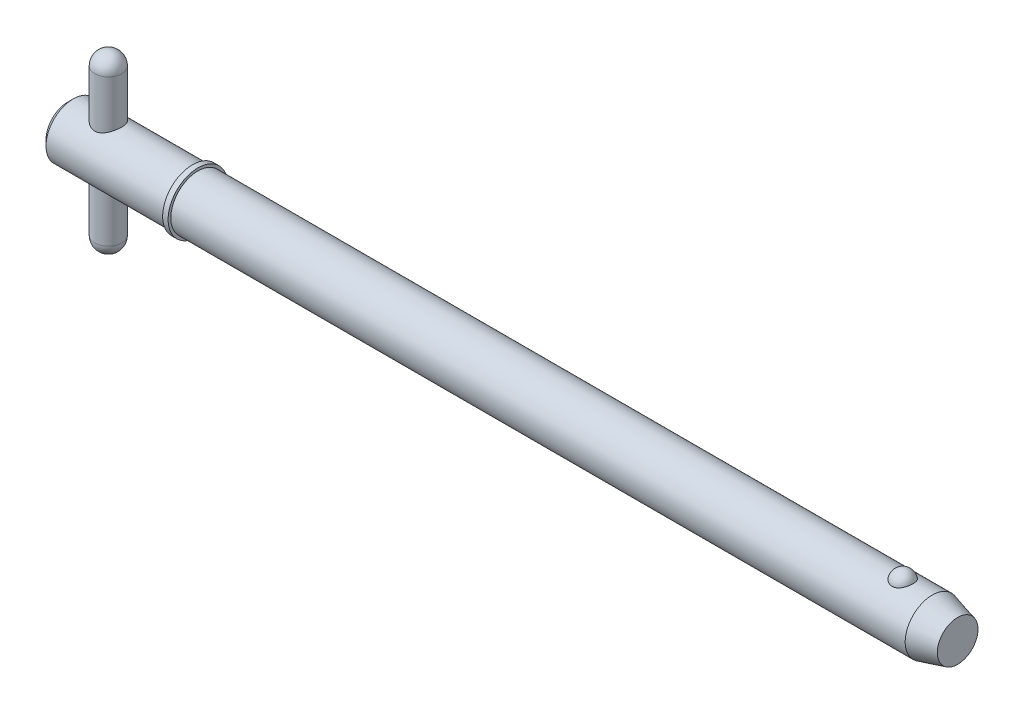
ISO-10303-21;
HEADER;
FILE_DESCRIPTION(('STEP AP214'),'2;1');
FILE_NAME('part.step','',(''),(''),'','','');
FILE_SCHEMA(('AUTOMOTIVE_DESIGN { 1 0 10303 214 1 1 1 1 }'));
ENDSEC;
DATA;
#1=APPLICATION_CONTEXT('core data for automotive mechanical design processes');
#2=APPLICATION_PROTOCOL_DEFINITION('international standard','automotive_design',2000,#1);
#3=PRODUCT_CONTEXT('',#1,'mechanical');
#4=PRODUCT('Part','Part','',(#3));
#5=PRODUCT_RELATED_PRODUCT_CATEGORY('part','',(#4));
#6=PRODUCT_DEFINITION_FORMATION('','',#4);
#7=PRODUCT_DEFINITION_CONTEXT('part definition',#1,'design');
#8=PRODUCT_DEFINITION('design','',#6,#7);
#9=PRODUCT_DEFINITION_SHAPE('','',#8);
#10=(LENGTH_UNIT() NAMED_UNIT(*) SI_UNIT(.MILLI.,.METRE.));
#11=(NAMED_UNIT(*) PLANE_ANGLE_UNIT() SI_UNIT($,.RADIAN.));
#12=(NAMED_UNIT(*) SI_UNIT($,.STERADIAN.) SOLID_ANGLE_UNIT());
#13=UNCERTAINTY_MEASURE_WITH_UNIT(LENGTH_MEASURE(1.E-05),#10,'distance_accuracy_value','');
#14=(GEOMETRIC_REPRESENTATION_CONTEXT(3) GLOBAL_UNCERTAINTY_ASSIGNED_CONTEXT((#13)) GLOBAL_UNIT_ASSIGNED_CONTEXT((#10,
#11,#12)) REPRESENTATION_CONTEXT('',''));
#15=CARTESIAN_POINT('',(0.,0.,0.));
#16=DIRECTION('',(0.,0.,1.));
#17=DIRECTION('',(1.,0.,0.));
#18=AXIS2_PLACEMENT_3D('',#15,#16,#17);
#19=CARTESIAN_POINT('',(5.94,12.7,0.));
#20=DIRECTION('',(0.,-1.,0.));
#21=DIRECTION('',(0.,0.,-1.));
#22=AXIS2_PLACEMENT_3D('',#19,#20,#21);
#23=CYLINDRICAL_SURFACE('',#22,1.98);
#24=CARTESIAN_POINT('',(5.94,-10.72,0.));
#25=DIRECTION('',(0.,-1.,0.));
#26=DIRECTION('',(0.,0.,-1.));
#27=AXIS2_PLACEMENT_3D('',#24,#25,#26);
#28=CIRCLE('',#27,1.98);
#29=CARTESIAN_POINT('',(5.94,-10.72,-1.98));
#30=VERTEX_POINT('',#29);
#31=EDGE_CURVE('P0_E10',#30,#30,#28,.F.);
#32=ORIENTED_EDGE('',*,*,#31,.T.);
#33=EDGE_LOOP('',(#32));
#34=FACE_BOUND('',#33,.T.);
#35=CARTESIAN_POINT('',(5.94,10.72,0.));
#36=DIRECTION('',(0.,-1.,0.));
#37=DIRECTION('',(0.,0.,-1.));
#38=AXIS2_PLACEMENT_3D('',#35,#36,#37);
#39=CIRCLE('',#38,1.98);
#40=CARTESIAN_POINT('',(5.94,10.72,-1.98));
#41=VERTEX_POINT('',#40);
#42=EDGE_CURVE('P0_E21',#41,#41,#39,.T.);
#43=ORIENTED_EDGE('',*,*,#42,.T.);
#44=EDGE_LOOP('',(#43));
#45=FACE_BOUND('',#44,.T.);
#46=ADVANCED_FACE('P0_F14',(#34,#45),#23,.T.);
#47=CARTESIAN_POINT('',(5.94,-10.72,0.));
#48=DIRECTION('',(0.,0.,1.));
#49=DIRECTION('',(1.,0.,0.));
#50=AXIS2_PLACEMENT_3D('',#47,#48,#49);
#51=SPHERICAL_SURFACE('',#50,1.98);
#52=CARTESIAN_POINT('',(5.94,-10.72,0.));
#53=DIRECTION('',(0.,-1.,0.));
#54=DIRECTION('',(0.,0.,-1.));
#55=AXIS2_PLACEMENT_3D('',#52,#53,#54);
#56=SPHERICAL_SURFACE('',#55,1.98);
#57=ORIENTED_EDGE('',*,*,#31,.F.);
#58=EDGE_LOOP('',(#57));
#59=FACE_BOUND('',#58,.T.);
#60=ADVANCED_FACE('P0_F29',(#59),#56,.T.);
#61=CARTESIAN_POINT('',(5.94,10.72,0.));
#62=DIRECTION('',(0.,0.,1.));
#63=DIRECTION('',(1.,0.,0.));
#64=AXIS2_PLACEMENT_3D('',#61,#62,#63);
#65=SPHERICAL_SURFACE('',#64,1.98);
#66=CARTESIAN_POINT('',(5.94,10.72,0.));
#67=DIRECTION('',(0.,-1.,0.));
#68=DIRECTION('',(0.,0.,-1.));
#69=AXIS2_PLACEMENT_3D('',#66,#67,#68);
#70=SPHERICAL_SURFACE('',#69,1.98);
#71=ORIENTED_EDGE('',*,*,#42,.F.);
#72=EDGE_LOOP('',(#71));
#73=FACE_BOUND('',#72,.T.);
#74=ADVANCED_FACE('P0_F16',(#73),#70,.T.);
#75=CLOSED_SHELL('',(#46,#60,#74));
#76=MANIFOLD_SOLID_BREP('P0_B1',#75);
#77=CARTESIAN_POINT('',(0.,0.,0.));
#78=DIRECTION('',(1.,0.,0.));
#79=DIRECTION('',(0.,0.,-1.));
#80=AXIS2_PLACEMENT_3D('',#77,#78,#79);
#81=CYLINDRICAL_SURFACE('',#80,3.97);
#82=CARTESIAN_POINT('',(126.475939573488,0.,0.));
#83=DIRECTION('',(1.,0.,0.));
#84=DIRECTION('',(0.,0.,-1.));
#85=AXIS2_PLACEMENT_3D('',#82,#83,#84);
#86=CIRCLE('',#85,3.97);
#87=CARTESIAN_POINT('',(126.475939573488,0.,-3.97));
#88=VERTEX_POINT('',#87);
#89=EDGE_CURVE('P1_E81',#88,#88,#86,.T.);
#90=ORIENTED_EDGE('',*,*,#89,.F.);
#91=EDGE_LOOP('',(#90));
#92=FACE_BOUND('',#91,.T.);
#93=CARTESIAN_POINT('',(19.05,0.,0.));
#94=DIRECTION('',(1.,0.,0.));
#95=DIRECTION('',(0.,0.,-1.));
#96=AXIS2_PLACEMENT_3D('',#93,#94,#95);
#97=CIRCLE('',#96,3.97);
#98=CARTESIAN_POINT('',(19.05,0.,-3.97));
#99=VERTEX_POINT('',#98);
#100=EDGE_CURVE('P1_E85',#99,#99,#97,.T.);
#101=ORIENTED_EDGE('',*,*,#100,.T.);
#102=EDGE_LOOP('',(#101));
#103=FACE_BOUND('',#102,.T.);
#104=CARTESIAN_POINT('',(122.145192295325,3.65715365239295,1.54470941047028));
#105=CARTESIAN_POINT('',(122.065244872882,3.65716001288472,1.54470290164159));
#106=CARTESIAN_POINT('',(121.985165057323,3.65987074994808,1.53832549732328));
#107=CARTESIAN_POINT('',(121.827237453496,3.6704221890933,1.51297018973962));
#108=CARTESIAN_POINT('',(121.74939614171,3.67827646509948,1.49395894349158));
#109=CARTESIAN_POINT('',(121.598461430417,3.69818848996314,1.44395950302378));
#110=CARTESIAN_POINT('',(121.525356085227,3.71023513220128,1.41300293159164));
#111=CARTESIAN_POINT('',(121.385563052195,3.73721833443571,1.34000212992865));
#112=CARTESIAN_POINT('',(121.318872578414,3.75215363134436,1.2979627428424));
#113=CARTESIAN_POINT('',(121.19148864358,3.78384968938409,1.20248834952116));
#114=CARTESIAN_POINT('',(121.131029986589,3.80065129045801,1.14875388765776));
#115=CARTESIAN_POINT('',(121.019694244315,3.83398532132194,1.03205417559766));
#116=CARTESIAN_POINT('',(120.968820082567,3.85051766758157,0.969086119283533));
#117=CARTESIAN_POINT('',(120.875632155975,3.88238608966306,0.832526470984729));
#118=CARTESIAN_POINT('',(120.833796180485,3.89763698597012,0.75858832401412));
#119=CARTESIAN_POINT('',(120.762510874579,3.92451063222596,0.60435211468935));
#120=CARTESIAN_POINT('',(120.733062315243,3.93613315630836,0.524053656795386));
#121=CARTESIAN_POINT('',(120.686892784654,3.95467606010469,0.358403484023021));
#122=CARTESIAN_POINT('',(120.670312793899,3.96154426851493,0.273006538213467));
#123=CARTESIAN_POINT('',(120.650756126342,3.96967008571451,0.100408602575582));
#124=CARTESIAN_POINT('',(120.647778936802,3.97092790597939,0.0132076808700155));
#125=CARTESIAN_POINT('',(120.655458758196,3.96771794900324,-0.159844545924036));
#126=CARTESIAN_POINT('',(120.666016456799,3.96329187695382,-0.245701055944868));
#127=CARTESIAN_POINT('',(120.70038009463,3.94923163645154,-0.41427746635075));
#128=CARTESIAN_POINT('',(120.724186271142,3.93959737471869,-0.496997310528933));
#129=CARTESIAN_POINT('',(120.78461142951,3.91607752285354,-0.657113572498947));
#130=CARTESIAN_POINT('',(120.821249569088,3.90218558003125,-0.734501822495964));
#131=CARTESIAN_POINT('',(120.906593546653,3.87158287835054,-0.881704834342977));
#132=CARTESIAN_POINT('',(120.955300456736,3.8548718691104,-0.951518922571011));
#133=CARTESIAN_POINT('',(121.064116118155,3.82028735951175,-1.08208159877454));
#134=CARTESIAN_POINT('',(121.124295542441,3.80240713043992,-1.14276958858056));
#135=CARTESIAN_POINT('',(121.254493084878,3.76758161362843,-1.2528243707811));
#136=CARTESIAN_POINT('',(121.324510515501,3.75063626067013,-1.30219195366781));
#137=CARTESIAN_POINT('',(121.47118160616,3.71998948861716,-1.38729709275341));
#138=CARTESIAN_POINT('',(121.547681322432,3.70623183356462,-1.42327904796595));
#139=CARTESIAN_POINT('',(121.706298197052,3.68323188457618,-1.48178996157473));
#140=CARTESIAN_POINT('',(121.7884132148,3.67398788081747,-1.5043240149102));
#141=CARTESIAN_POINT('',(121.951481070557,3.6615216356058,-1.53440939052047));
#142=CARTESIAN_POINT('',(122.032284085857,3.65801951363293,-1.54265826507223));
#143=CARTESIAN_POINT('',(122.19420850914,3.65657341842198,-1.54608423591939));
#144=CARTESIAN_POINT('',(122.275329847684,3.65862829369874,-1.54126404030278));
#145=CARTESIAN_POINT('',(122.432812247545,3.66788969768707,-1.51908474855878));
#146=CARTESIAN_POINT('',(122.509242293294,3.67492621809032,-1.50213925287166));
#147=CARTESIAN_POINT('',(122.658041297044,3.69318404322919,-1.45666982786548));
#148=CARTESIAN_POINT('',(122.730409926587,3.70440568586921,-1.42814496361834));
#149=CARTESIAN_POINT('',(122.870802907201,3.73012749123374,-1.35956319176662));
#150=CARTESIAN_POINT('',(122.938700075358,3.74469307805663,-1.31927107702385));
#151=CARTESIAN_POINT('',(123.066864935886,3.77545272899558,-1.22847440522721));
#152=CARTESIAN_POINT('',(123.127130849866,3.79164717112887,-1.17796747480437));
#153=CARTESIAN_POINT('',(123.241634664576,3.82490325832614,-1.06519260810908));
#154=CARTESIAN_POINT('',(123.295413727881,3.84196735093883,-1.00245914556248));
#155=CARTESIAN_POINT('',(123.392098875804,3.87439863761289,-0.868715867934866));
#156=CARTESIAN_POINT('',(123.435003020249,3.88976552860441,-0.797704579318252));
#157=CARTESIAN_POINT('',(123.510266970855,3.91771381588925,-0.646896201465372));
#158=CARTESIAN_POINT('',(123.54225322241,3.93019255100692,-0.566893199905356));
#159=CARTESIAN_POINT('',(123.593110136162,3.95043886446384,-0.402255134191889));
#160=CARTESIAN_POINT('',(123.611980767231,3.95820643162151,-0.317620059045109));
#161=CARTESIAN_POINT('',(123.63621625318,3.96823733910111,-0.146156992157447));
#162=CARTESIAN_POINT('',(123.641587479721,3.970503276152,-0.0593300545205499));
#163=CARTESIAN_POINT('',(123.638730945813,3.96930811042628,0.114057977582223));
#164=CARTESIAN_POINT('',(123.630503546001,3.9658471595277,0.200619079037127));
#165=CARTESIAN_POINT('',(123.600706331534,3.95358562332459,0.370506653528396));
#166=CARTESIAN_POINT('',(123.57921294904,3.94481563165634,0.453848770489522));
#167=CARTESIAN_POINT('',(123.52338397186,3.92284586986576,0.615497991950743));
#168=CARTESIAN_POINT('',(123.489047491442,3.90964579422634,0.693804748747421));
#169=CARTESIAN_POINT('',(123.407970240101,3.88006987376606,0.843703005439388));
#170=CARTESIAN_POINT('',(123.361153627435,3.86367478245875,0.915249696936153));
#171=CARTESIAN_POINT('',(123.256189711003,3.82949741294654,1.04910810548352));
#172=CARTESIAN_POINT('',(123.198042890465,3.81171519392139,1.11142021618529));
#173=CARTESIAN_POINT('',(123.071743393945,3.77673366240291,1.22503948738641));
#174=CARTESIAN_POINT('',(123.003597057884,3.75953398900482,1.27635357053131));
#175=CARTESIAN_POINT('',(122.858900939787,3.72770506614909,1.36653336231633));
#176=CARTESIAN_POINT('',(122.782348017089,3.71307678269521,1.40539439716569));
#177=CARTESIAN_POINT('',(122.625759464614,3.68864287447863,1.46830480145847));
#178=CARTESIAN_POINT('',(122.545930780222,3.67869017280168,1.49281289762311));
#179=CARTESIAN_POINT('',(122.382987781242,3.66414535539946,1.52817474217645));
#180=CARTESIAN_POINT('',(122.299884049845,3.65953723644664,1.53906926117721));
#181=CARTESIAN_POINT('',(122.192776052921,3.6573894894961,1.54414878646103));
#182=CARTESIAN_POINT('',(122.168990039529,3.65715175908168,1.54471134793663));
#183=CARTESIAN_POINT('',(122.145192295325,3.65715365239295,1.54470941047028));
#184=B_SPLINE_CURVE_WITH_KNOTS('',3,(#104,#105,#106,#107,#108,#109,#110,#111,#112,#113,#114,
#115,#116,#117,#118,#119,#120,#121,#122,#123,#124,#125,#126,#127,#128,#129,#130,#131,#132,#133,
#134,#135,#136,#137,#138,#139,#140,#141,#142,#143,#144,#145,#146,#147,#148,#149,#150,#151,#152,
#153,#154,#155,#156,#157,#158,#159,#160,#161,#162,#163,#164,#165,#166,#167,#168,#169,#170,#171,
#172,#173,#174,#175,#176,#177,#178,#179,#180,#181,#182,#183),.UNSPECIFIED.,.T.,.F.,(4,2,2,2,2,2,
2,2,2,2,2,2,2,2,2,2,2,2,2,2,2,2,2,2,2,2,2,2,2,2,2,2,2,2,2,2,2,2,2,4),(0.,0.239777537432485,
0.480190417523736,0.719971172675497,0.959647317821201,1.20639040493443,1.45320863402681,
1.7109367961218,1.96868099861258,2.22921052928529,2.48973023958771,2.74834928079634,
3.00697295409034,3.26598440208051,3.52501886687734,3.78570385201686,4.04637062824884,
4.30201257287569,4.5575576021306,4.80022994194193,5.04285200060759,5.27757006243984,
5.51230707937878,5.75210128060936,5.99195126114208,6.24392810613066,6.49594987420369,
6.75588818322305,7.01582710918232,7.27564332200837,7.53545264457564,7.79377886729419,
8.0521229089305,8.31207418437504,8.57201437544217,8.83179046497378,9.09166393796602,
9.34270057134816,9.59298357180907,9.66435753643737),.UNSPECIFIED.);
#185=CARTESIAN_POINT('',(122.145192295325,3.65715365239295,1.54470941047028));
#186=VERTEX_POINT('',#185);
#187=EDGE_CURVE('P1_E35',#186,#186,#184,.T.);
#188=ORIENTED_EDGE('',*,*,#187,.T.);
#189=EDGE_LOOP('',(#188));
#190=FACE_BOUND('',#189,.T.);
#191=ADVANCED_FACE('P1_F13',(#92,#103,#190),#81,.T.);
#192=CARTESIAN_POINT('',(0.,0.,0.));
#193=DIRECTION('',(-1.,0.,0.));
#194=DIRECTION('',(0.,0.,1.));
#195=AXIS2_PLACEMENT_3D('',#192,#193,#194);
#196=PLANE('',#195);
#197=CARTESIAN_POINT('',(0.,0.,0.));
#198=DIRECTION('',(1.,0.,0.));
#199=DIRECTION('',(0.,0.,-1.));
#200=AXIS2_PLACEMENT_3D('',#197,#198,#199);
#201=CIRCLE('',#200,3.176);
#202=CARTESIAN_POINT('',(0.,0.,-3.176));
#203=VERTEX_POINT('',#202);
#204=EDGE_CURVE('P1_E9',#203,#203,#201,.T.);
#205=ORIENTED_EDGE('',*,*,#204,.F.);
#206=EDGE_LOOP('',(#205));
#207=FACE_BOUND('',#206,.T.);
#208=ADVANCED_FACE('P1_F15',(#207),#196,.T.);
#209=CARTESIAN_POINT('',(0.793999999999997,0.,0.));
#210=DIRECTION('',(1.,0.,0.));
#211=DIRECTION('',(0.,0.,-1.));
#212=AXIS2_PLACEMENT_3D('',#209,#210,#211);
#213=CONICAL_SURFACE('',#212,3.97,0.78539816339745);
#214=ORIENTED_EDGE('',*,*,#204,.T.);
#215=EDGE_LOOP('',(#214));
#216=FACE_BOUND('',#215,.T.);
#217=CARTESIAN_POINT('',(0.793999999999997,0.,0.));
#218=DIRECTION('',(1.,0.,0.));
#219=DIRECTION('',(0.,0.,-1.));
#220=AXIS2_PLACEMENT_3D('',#217,#218,#219);
#221=CIRCLE('',#220,3.97);
#222=CARTESIAN_POINT('',(0.793999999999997,0.,-3.97));
#223=VERTEX_POINT('',#222);
#224=EDGE_CURVE('P1_E26',#223,#223,#221,.T.);
#225=ORIENTED_EDGE('',*,*,#224,.F.);
#226=EDGE_LOOP('',(#225));
#227=FACE_BOUND('',#226,.T.);
#228=ADVANCED_FACE('P1_F77',(#216,#227),#213,.T.);
#229=CARTESIAN_POINT('',(0.,0.,0.));
#230=DIRECTION('',(1.,0.,0.));
#231=DIRECTION('',(0.,0.,-1.));
#232=AXIS2_PLACEMENT_3D('',#229,#230,#231);
#233=CYLINDRICAL_SURFACE('',#232,3.97);
#234=CARTESIAN_POINT('',(5.94,-3.44100276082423,1.98));
#235=CARTESIAN_POINT('',(5.8367885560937,-3.44101282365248,1.97999171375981));
#236=CARTESIAN_POINT('',(5.73344176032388,-3.44571749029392,1.97187534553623));
#237=CARTESIAN_POINT('',(5.52991905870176,-3.46385873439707,1.93981946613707));
#238=CARTESIAN_POINT('',(5.42975031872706,-3.47731375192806,1.91584653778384));
#239=CARTESIAN_POINT('',(5.23590869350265,-3.51100678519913,1.85336773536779));
#240=CARTESIAN_POINT('',(5.14220446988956,-3.53120882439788,1.81493880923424));
#241=CARTESIAN_POINT('',(4.9625969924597,-3.57606420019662,1.72487335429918));
#242=CARTESIAN_POINT('',(4.87669412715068,-3.6007177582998,1.67323616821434));
#243=CARTESIAN_POINT('',(4.70734412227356,-3.65417020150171,1.55325205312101));
#244=CARTESIAN_POINT('',(4.62467662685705,-3.68314323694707,1.4838818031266));
#245=CARTESIAN_POINT('',(4.47154355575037,-3.74056406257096,1.33252902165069));
#246=CARTESIAN_POINT('',(4.40108404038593,-3.76901158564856,1.25054026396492));
#247=CARTESIAN_POINT('',(4.26974803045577,-3.82445556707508,1.06956584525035));
#248=CARTESIAN_POINT('',(4.20982960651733,-3.8512271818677,0.969809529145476));
#249=CARTESIAN_POINT('',(4.10798077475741,-3.89804342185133,0.760047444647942));
#250=CARTESIAN_POINT('',(4.06603907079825,-3.91809226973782,0.650048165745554));
#251=CARTESIAN_POINT('',(4.00441878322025,-3.94794912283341,0.431181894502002));
#252=CARTESIAN_POINT('',(3.98337329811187,-3.95838209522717,0.322786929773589));
#253=CARTESIAN_POINT('',(3.9596425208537,-3.97016407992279,0.103541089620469));
#254=CARTESIAN_POINT('',(3.95694618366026,-3.97151855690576,-0.00730826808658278));
#255=CARTESIAN_POINT('',(3.9694599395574,-3.96528826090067,-0.218044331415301));
#256=CARTESIAN_POINT('',(3.98314071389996,-3.95846689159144,-0.318049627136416));
#257=CARTESIAN_POINT('',(4.02528522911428,-3.93780347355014,-0.514124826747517));
#258=CARTESIAN_POINT('',(4.05375007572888,-3.92396089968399,-0.61019443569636));
#259=CARTESIAN_POINT('',(4.12484256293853,-3.89028355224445,-0.797351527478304));
#260=CARTESIAN_POINT('',(4.16766142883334,-3.87036821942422,-0.888351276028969));
#261=CARTESIAN_POINT('',(4.26598377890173,-3.82634285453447,-1.06209448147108));
#262=CARTESIAN_POINT('',(4.32149181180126,-3.8022313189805,-1.14483496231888));
#263=CARTESIAN_POINT('',(4.44962332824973,-3.74940011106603,-1.30802500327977));
#264=CARTESIAN_POINT('',(4.52336636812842,-3.72046031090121,-1.38752498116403));
#265=CARTESIAN_POINT('',(4.68287656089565,-3.66269463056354,-1.53354043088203));
#266=CARTESIAN_POINT('',(4.7686527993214,-3.63386885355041,-1.60004599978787));
#267=CARTESIAN_POINT('',(4.9564069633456,-3.57763161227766,-1.72228426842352));
#268=CARTESIAN_POINT('',(5.05906485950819,-3.5504233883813,-1.77707534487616));
#269=CARTESIAN_POINT('',(5.27381412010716,-3.50334038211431,-1.86819784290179));
#270=CARTESIAN_POINT('',(5.38589553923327,-3.48345798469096,-1.90454844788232));
#271=CARTESIAN_POINT('',(5.6069795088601,-3.45548331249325,-1.95481643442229));
#272=CARTESIAN_POINT('',(5.71552407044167,-3.44658268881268,-1.97028113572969));
#273=CARTESIAN_POINT('',(5.93399639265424,-3.43928114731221,-1.98300600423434));
#274=CARTESIAN_POINT('',(6.04392313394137,-3.44087289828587,-1.98027888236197));
#275=CARTESIAN_POINT('',(6.24931618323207,-3.45351901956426,-1.95811780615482));
#276=CARTESIAN_POINT('',(6.34505668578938,-3.46352725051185,-1.94052989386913));
#277=CARTESIAN_POINT('',(6.53204702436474,-3.49033612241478,-1.89188242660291));
#278=CARTESIAN_POINT('',(6.62329540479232,-3.50713894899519,-1.86081853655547));
#279=CARTESIAN_POINT('',(6.80352105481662,-3.54655680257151,-1.78458666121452));
#280=CARTESIAN_POINT('',(6.89219712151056,-3.56940508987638,-1.73883178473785));
#281=CARTESIAN_POINT('',(7.06112449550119,-3.61813012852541,-1.63502913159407));
#282=CARTESIAN_POINT('',(7.14137144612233,-3.6440084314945,-1.57697504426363));
#283=CARTESIAN_POINT('',(7.30168083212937,-3.69977514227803,-1.44171920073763));
#284=CARTESIAN_POINT('',(7.38046039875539,-3.7297597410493,-1.36302972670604));
#285=CARTESIAN_POINT('',(7.52409649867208,-3.78754991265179,-1.19307190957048));
#286=CARTESIAN_POINT('',(7.58894840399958,-3.81535475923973,-1.10179940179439));
#287=CARTESIAN_POINT('',(7.70430122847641,-3.86658972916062,-0.906019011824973));
#288=CARTESIAN_POINT('',(7.75438714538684,-3.88988795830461,-0.801229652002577));
#289=CARTESIAN_POINT('',(7.83572184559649,-3.92848199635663,-0.583216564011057));
#290=CARTESIAN_POINT('',(7.86698708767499,-3.94378479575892,-0.470000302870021));
#291=CARTESIAN_POINT('',(7.90711051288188,-3.96355307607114,-0.249525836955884));
#292=CARTESIAN_POINT('',(7.91775648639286,-3.96888171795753,-0.142669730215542));
#293=CARTESIAN_POINT('',(7.92160247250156,-3.97079858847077,0.0714191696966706));
#294=CARTESIAN_POINT('',(7.91480852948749,-3.96738984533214,0.178651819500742));
#295=CARTESIAN_POINT('',(7.88515479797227,-3.9527181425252,0.383072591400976));
#296=CARTESIAN_POINT('',(7.8633739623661,-3.94198303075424,0.480459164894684));
#297=CARTESIAN_POINT('',(7.80581513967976,-3.91422178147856,0.670038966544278));
#298=CARTESIAN_POINT('',(7.77003513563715,-3.89719473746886,0.762231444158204));
#299=CARTESIAN_POINT('',(7.68389191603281,-3.85747818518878,0.943248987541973));
#300=CARTESIAN_POINT('',(7.63296879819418,-3.83457704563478,1.03175978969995));
#301=CARTESIAN_POINT('',(7.51869140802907,-3.7855122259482,1.19934744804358));
#302=CARTESIAN_POINT('',(7.45533142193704,-3.75934704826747,1.2784199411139));
#303=CARTESIAN_POINT('',(7.31068939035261,-3.70329841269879,1.433144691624));
#304=CARTESIAN_POINT('',(7.22825362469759,-3.67330340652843,1.50768183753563));
#305=CARTESIAN_POINT('',(7.05162367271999,-3.61514025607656,1.64226879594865));
#306=CARTESIAN_POINT('',(6.95741928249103,-3.58697372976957,1.70230590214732));
#307=CARTESIAN_POINT('',(6.75590859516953,-3.53504049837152,1.80775364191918));
#308=CARTESIAN_POINT('',(6.64828786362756,-3.51143624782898,1.85265616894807));
#309=CARTESIAN_POINT('',(6.48137774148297,-3.48289659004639,1.90544537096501));
#310=CARTESIAN_POINT('',(6.42488151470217,-3.4745323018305,1.9206071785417));
#311=CARTESIAN_POINT('',(6.31046920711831,-3.4604244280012,1.94591259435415));
#312=CARTESIAN_POINT('',(6.25255415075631,-3.45467900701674,1.95605971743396));
#313=CARTESIAN_POINT('',(6.1521444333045,-3.44728060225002,1.96905939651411));
#314=CARTESIAN_POINT('',(6.10985721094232,-3.44493297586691,1.97315742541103));
#315=CARTESIAN_POINT('',(6.02505433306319,-3.44179192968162,1.97862952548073));
#316=CARTESIAN_POINT('',(5.98253866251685,-3.44099861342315,1.98000341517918));
#317=CARTESIAN_POINT('',(5.94,-3.44100276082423,1.98));
#318=B_SPLINE_CURVE_WITH_KNOTS('',3,(#234,#235,#236,#237,#238,#239,#240,#241,#242,#243,#244,
#245,#246,#247,#248,#249,#250,#251,#252,#253,#254,#255,#256,#257,#258,#259,#260,#261,#262,#263,
#264,#265,#266,#267,#268,#269,#270,#271,#272,#273,#274,#275,#276,#277,#278,#279,#280,#281,#282,
#283,#284,#285,#286,#287,#288,#289,#290,#291,#292,#293,#294,#295,#296,#297,#298,#299,#300,#301,
#302,#303,#304,#305,#306,#307,#308,#309,#310,#311,#312,#313,#314,#315,#316,#317),.UNSPECIFIED.,
.T.,.F.,(4,2,2,2,2,2,2,2,2,2,2,2,2,2,2,2,2,2,2,2,2,2,2,2,2,2,2,2,2,2,2,2,2,2,2,2,2,2,2,2,2,4),
(0.,0.309462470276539,0.619579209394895,0.928068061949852,1.23657226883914,1.57038619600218,
1.90436536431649,2.26071614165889,2.61684266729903,2.94773555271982,3.27842924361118,
3.58050679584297,3.88260694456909,4.18890317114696,4.49530936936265,4.83057163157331,
5.1660884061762,5.52272472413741,5.87898927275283,6.20706708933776,6.53491569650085,
6.82716910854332,7.11951660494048,7.42541184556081,7.73146442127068,8.07586334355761,
8.42037652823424,8.77380887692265,9.12693169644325,9.44775848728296,9.76847409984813,
10.0682302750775,10.3680296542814,10.6806938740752,10.9935020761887,11.3373031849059,
11.6814044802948,12.0361164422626,12.2131519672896,12.3900632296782,12.5175998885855,
12.6451450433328),.UNSPECIFIED.);
#319=CARTESIAN_POINT('',(5.94,-3.44100276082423,1.98));
#320=VERTEX_POINT('',#319);
#321=EDGE_CURVE('P1_E17',#320,#320,#318,.T.);
#322=ORIENTED_EDGE('',*,*,#321,.F.);
#323=EDGE_LOOP('',(#322));
#324=FACE_BOUND('',#323,.T.);
#325=CARTESIAN_POINT('',(5.94,3.44100276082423,1.98));
#326=CARTESIAN_POINT('',(6.0432114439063,3.44101282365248,1.97999171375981));
#327=CARTESIAN_POINT('',(6.14655823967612,3.44571749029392,1.97187534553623));
#328=CARTESIAN_POINT('',(6.35008094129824,3.46385873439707,1.93981946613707));
#329=CARTESIAN_POINT('',(6.45024968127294,3.47731375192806,1.91584653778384));
#330=CARTESIAN_POINT('',(6.64409130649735,3.51100678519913,1.85336773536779));
#331=CARTESIAN_POINT('',(6.73779553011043,3.53120882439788,1.81493880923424));
#332=CARTESIAN_POINT('',(6.91740300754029,3.57606420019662,1.72487335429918));
#333=CARTESIAN_POINT('',(7.00330587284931,3.6007177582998,1.67323616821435));
#334=CARTESIAN_POINT('',(7.17265587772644,3.65417020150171,1.55325205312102));
#335=CARTESIAN_POINT('',(7.25532337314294,3.68314323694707,1.4838818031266));
#336=CARTESIAN_POINT('',(7.40845644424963,3.74056406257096,1.3325290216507));
#337=CARTESIAN_POINT('',(7.47891595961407,3.76901158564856,1.25054026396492));
#338=CARTESIAN_POINT('',(7.61025196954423,3.82445556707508,1.06956584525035));
#339=CARTESIAN_POINT('',(7.67017039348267,3.8512271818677,0.969809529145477));
#340=CARTESIAN_POINT('',(7.77201922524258,3.89804342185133,0.760047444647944));
#341=CARTESIAN_POINT('',(7.81396092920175,3.91809226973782,0.650048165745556));
#342=CARTESIAN_POINT('',(7.87558121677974,3.94794912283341,0.431181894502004));
#343=CARTESIAN_POINT('',(7.89662670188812,3.95838209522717,0.322786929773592));
#344=CARTESIAN_POINT('',(7.9203574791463,3.97016407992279,0.103541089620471));
#345=CARTESIAN_POINT('',(7.92305381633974,3.97151855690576,-0.00730826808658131));
#346=CARTESIAN_POINT('',(7.9105400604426,3.96528826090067,-0.2180443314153));
#347=CARTESIAN_POINT('',(7.89685928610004,3.95846689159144,-0.318049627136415));
#348=CARTESIAN_POINT('',(7.85471477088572,3.93780347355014,-0.514124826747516));
#349=CARTESIAN_POINT('',(7.82624992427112,3.92396089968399,-0.61019443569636));
#350=CARTESIAN_POINT('',(7.75515743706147,3.89028355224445,-0.797351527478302));
#351=CARTESIAN_POINT('',(7.71233857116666,3.87036821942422,-0.888351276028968));
#352=CARTESIAN_POINT('',(7.61401622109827,3.82634285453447,-1.06209448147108));
#353=CARTESIAN_POINT('',(7.55850818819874,3.8022313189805,-1.14483496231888));
#354=CARTESIAN_POINT('',(7.43037667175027,3.74940011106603,-1.30802500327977));
#355=CARTESIAN_POINT('',(7.35663363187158,3.72046031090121,-1.38752498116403));
#356=CARTESIAN_POINT('',(7.19712343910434,3.66269463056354,-1.53354043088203));
#357=CARTESIAN_POINT('',(7.1113472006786,3.63386885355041,-1.60004599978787));
#358=CARTESIAN_POINT('',(6.9235930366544,3.57763161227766,-1.72228426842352));
#359=CARTESIAN_POINT('',(6.82093514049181,3.5504233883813,-1.77707534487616));
#360=CARTESIAN_POINT('',(6.60618587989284,3.50334038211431,-1.86819784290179));
#361=CARTESIAN_POINT('',(6.49410446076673,3.48345798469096,-1.90454844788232));
#362=CARTESIAN_POINT('',(6.2730204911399,3.45548331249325,-1.95481643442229));
#363=CARTESIAN_POINT('',(6.16447592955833,3.44658268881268,-1.97028113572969));
#364=CARTESIAN_POINT('',(5.94600360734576,3.43928114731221,-1.98300600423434));
#365=CARTESIAN_POINT('',(5.83607686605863,3.44087289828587,-1.98027888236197));
#366=CARTESIAN_POINT('',(5.63068381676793,3.45351901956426,-1.95811780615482));
#367=CARTESIAN_POINT('',(5.53494331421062,3.46352725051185,-1.94052989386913));
#368=CARTESIAN_POINT('',(5.34795297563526,3.49033612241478,-1.89188242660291));
#369=CARTESIAN_POINT('',(5.25670459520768,3.50713894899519,-1.86081853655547));
#370=CARTESIAN_POINT('',(5.07647894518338,3.54655680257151,-1.78458666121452));
#371=CARTESIAN_POINT('',(4.98780287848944,3.56940508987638,-1.73883178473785));
#372=CARTESIAN_POINT('',(4.81887550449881,3.61813012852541,-1.63502913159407));
#373=CARTESIAN_POINT('',(4.73862855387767,3.6440084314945,-1.57697504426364));
#374=CARTESIAN_POINT('',(4.57831916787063,3.69977514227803,-1.44171920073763));
#375=CARTESIAN_POINT('',(4.49953960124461,3.7297597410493,-1.36302972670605));
#376=CARTESIAN_POINT('',(4.35590350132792,3.78754991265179,-1.19307190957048));
#377=CARTESIAN_POINT('',(4.29105159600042,3.81535475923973,-1.10179940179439));
#378=CARTESIAN_POINT('',(4.17569877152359,3.86658972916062,-0.906019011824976));
#379=CARTESIAN_POINT('',(4.12561285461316,3.88988795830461,-0.80122965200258));
#380=CARTESIAN_POINT('',(4.04427815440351,3.92848199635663,-0.58321656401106));
#381=CARTESIAN_POINT('',(4.01301291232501,3.94378479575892,-0.470000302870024));
#382=CARTESIAN_POINT('',(3.97288948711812,3.96355307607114,-0.249525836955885));
#383=CARTESIAN_POINT('',(3.96224351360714,3.96888171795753,-0.142669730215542));
#384=CARTESIAN_POINT('',(3.95839752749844,3.97079858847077,0.0714191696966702));
#385=CARTESIAN_POINT('',(3.96519147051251,3.96738984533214,0.178651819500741));
#386=CARTESIAN_POINT('',(3.99484520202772,3.9527181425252,0.383072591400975));
#387=CARTESIAN_POINT('',(4.01662603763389,3.94198303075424,0.480459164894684));
#388=CARTESIAN_POINT('',(4.07418486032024,3.91422178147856,0.670038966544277));
#389=CARTESIAN_POINT('',(4.10996486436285,3.89719473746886,0.762231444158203));
#390=CARTESIAN_POINT('',(4.19610808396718,3.85747818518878,0.943248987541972));
#391=CARTESIAN_POINT('',(4.24703120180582,3.83457704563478,1.03175978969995));
#392=CARTESIAN_POINT('',(4.36130859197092,3.7855122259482,1.19934744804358));
#393=CARTESIAN_POINT('',(4.42466857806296,3.75934704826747,1.2784199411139));
#394=CARTESIAN_POINT('',(4.56931060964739,3.70329841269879,1.433144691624));
#395=CARTESIAN_POINT('',(4.65174637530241,3.67330340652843,1.50768183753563));
#396=CARTESIAN_POINT('',(4.82837632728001,3.61514025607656,1.64226879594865));
#397=CARTESIAN_POINT('',(4.92258071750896,3.58697372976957,1.70230590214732));
#398=CARTESIAN_POINT('',(5.12409140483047,3.53504049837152,1.80775364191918));
#399=CARTESIAN_POINT('',(5.23171213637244,3.51143624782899,1.85265616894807));
#400=CARTESIAN_POINT('',(5.39862225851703,3.48289659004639,1.90544537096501));
#401=CARTESIAN_POINT('',(5.45511848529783,3.4745323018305,1.9206071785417));
#402=CARTESIAN_POINT('',(5.56953079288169,3.4604244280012,1.94591259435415));
#403=CARTESIAN_POINT('',(5.62744584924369,3.45467900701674,1.95605971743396));
#404=CARTESIAN_POINT('',(5.7278555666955,3.44728060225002,1.9690593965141));
#405=CARTESIAN_POINT('',(5.77014278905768,3.44493297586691,1.97315742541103));
#406=CARTESIAN_POINT('',(5.85494566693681,3.44179192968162,1.97862952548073));
#407=CARTESIAN_POINT('',(5.89746133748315,3.44099861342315,1.98000341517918));
#408=CARTESIAN_POINT('',(5.94,3.44100276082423,1.98));
#409=B_SPLINE_CURVE_WITH_KNOTS('',3,(#325,#326,#327,#328,#329,#330,#331,#332,#333,#334,#335,
#336,#337,#338,#339,#340,#341,#342,#343,#344,#345,#346,#347,#348,#349,#350,#351,#352,#353,#354,
#355,#356,#357,#358,#359,#360,#361,#362,#363,#364,#365,#366,#367,#368,#369,#370,#371,#372,#373,
#374,#375,#376,#377,#378,#379,#380,#381,#382,#383,#384,#385,#386,#387,#388,#389,#390,#391,#392,
#393,#394,#395,#396,#397,#398,#399,#400,#401,#402,#403,#404,#405,#406,#407,#408),.UNSPECIFIED.,
.T.,.F.,(4,2,2,2,2,2,2,2,2,2,2,2,2,2,2,2,2,2,2,2,2,2,2,2,2,2,2,2,2,2,2,2,2,2,2,2,2,2,2,2,2,4),
(0.,0.309462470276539,0.619579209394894,0.928068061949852,1.23657226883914,1.57038619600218,
1.90436536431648,2.26071614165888,2.61684266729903,2.94773555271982,3.27842924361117,
3.58050679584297,3.88260694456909,4.18890317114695,4.49530936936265,4.83057163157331,
5.1660884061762,5.5227247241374,5.87898927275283,6.20706708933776,6.53491569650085,
6.82716910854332,7.11951660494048,7.42541184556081,7.73146442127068,8.07586334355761,
8.42037652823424,8.77380887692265,9.12693169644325,9.44775848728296,9.76847409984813,
10.0682302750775,10.3680296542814,10.6806938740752,10.9935020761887,11.3373031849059,
11.6814044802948,12.0361164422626,12.2131519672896,12.3900632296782,12.5175998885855,
12.6451450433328),.UNSPECIFIED.);
#410=CARTESIAN_POINT('',(5.94,3.44100276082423,1.98));
#411=VERTEX_POINT('',#410);
#412=EDGE_CURVE('P1_E43',#411,#411,#409,.T.);
#413=ORIENTED_EDGE('',*,*,#412,.F.);
#414=EDGE_LOOP('',(#413));
#415=FACE_BOUND('',#414,.T.);
#416=ORIENTED_EDGE('',*,*,#224,.T.);
#417=EDGE_LOOP('',(#416));
#418=FACE_BOUND('',#417,.T.);
#419=CARTESIAN_POINT('',(18.256,0.,0.));
#420=DIRECTION('',(1.,0.,0.));
#421=DIRECTION('',(0.,0.,-1.));
#422=AXIS2_PLACEMENT_3D('',#419,#420,#421);
#423=CIRCLE('',#422,3.97);
#424=CARTESIAN_POINT('',(18.256,0.,-3.97));
#425=VERTEX_POINT('',#424);
#426=EDGE_CURVE('P1_E31',#425,#425,#423,.T.);
#427=ORIENTED_EDGE('',*,*,#426,.F.);
#428=EDGE_LOOP('',(#427));
#429=FACE_BOUND('',#428,.T.);
#430=ADVANCED_FACE('P1_F103',(#324,#415,#418,#429),#233,.T.);
#431=CARTESIAN_POINT('',(18.256,3.97,0.));
#432=DIRECTION('',(-1.,0.,0.));
#433=DIRECTION('',(0.,0.,1.));
#434=AXIS2_PLACEMENT_3D('',#431,#432,#433);
#435=PLANE('',#434);
#436=ORIENTED_EDGE('',*,*,#426,.T.);
#437=EDGE_LOOP('',(#436));
#438=FACE_BOUND('',#437,.T.);
#439=CARTESIAN_POINT('',(18.256,0.,0.));
#440=DIRECTION('',(1.,0.,0.));
#441=DIRECTION('',(0.,0.,-1.));
#442=AXIS2_PLACEMENT_3D('',#439,#440,#441);
#443=CIRCLE('',#442,4.367);
#444=CARTESIAN_POINT('',(18.256,0.,-4.367));
#445=VERTEX_POINT('',#444);
#446=EDGE_CURVE('P1_E91',#445,#445,#443,.T.);
#447=ORIENTED_EDGE('',*,*,#446,.F.);
#448=EDGE_LOOP('',(#447));
#449=FACE_BOUND('',#448,.T.);
#450=ADVANCED_FACE('P1_F100',(#438,#449),#435,.T.);
#451=CARTESIAN_POINT('',(0.,0.,0.));
#452=DIRECTION('',(1.,0.,0.));
#453=DIRECTION('',(0.,0.,-1.));
#454=AXIS2_PLACEMENT_3D('',#451,#452,#453);
#455=CYLINDRICAL_SURFACE('',#454,4.367);
#456=ORIENTED_EDGE('',*,*,#446,.T.);
#457=EDGE_LOOP('',(#456));
#458=FACE_BOUND('',#457,.T.);
#459=CARTESIAN_POINT('',(19.05,0.,0.));
#460=DIRECTION('',(1.,0.,0.));
#461=DIRECTION('',(0.,0.,-1.));
#462=AXIS2_PLACEMENT_3D('',#459,#460,#461);
#463=CIRCLE('',#462,4.367);
#464=CARTESIAN_POINT('',(19.05,0.,-4.367));
#465=VERTEX_POINT('',#464);
#466=EDGE_CURVE('P1_E88',#465,#465,#463,.T.);
#467=ORIENTED_EDGE('',*,*,#466,.F.);
#468=EDGE_LOOP('',(#467));
#469=FACE_BOUND('',#468,.T.);
#470=ADVANCED_FACE('P1_F68',(#458,#469),#455,.T.);
#471=CARTESIAN_POINT('',(19.05,4.367,0.));
#472=DIRECTION('',(1.,0.,0.));
#473=DIRECTION('',(0.,0.,-1.));
#474=AXIS2_PLACEMENT_3D('',#471,#472,#473);
#475=PLANE('',#474);
#476=ORIENTED_EDGE('',*,*,#466,.T.);
#477=EDGE_LOOP('',(#476));
#478=FACE_BOUND('',#477,.T.);
#479=ORIENTED_EDGE('',*,*,#100,.F.);
#480=EDGE_LOOP('',(#479));
#481=FACE_BOUND('',#480,.T.);
#482=ADVANCED_FACE('P1_F62',(#478,#481),#475,.T.);
#483=CARTESIAN_POINT('',(130.18,0.,0.));
#484=DIRECTION('',(-1.,0.,0.));
#485=DIRECTION('',(0.,0.,1.));
#486=AXIS2_PLACEMENT_3D('',#483,#484,#485);
#487=CONICAL_SURFACE('',#486,2.97750000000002,0.261799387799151);
#488=ORIENTED_EDGE('',*,*,#89,.T.);
#489=EDGE_LOOP('',(#488));
#490=FACE_BOUND('',#489,.T.);
#491=CARTESIAN_POINT('',(130.18,0.,0.));
#492=DIRECTION('',(1.,0.,0.));
#493=DIRECTION('',(0.,0.,-1.));
#494=AXIS2_PLACEMENT_3D('',#491,#492,#493);
#495=CIRCLE('',#494,2.97750000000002);
#496=CARTESIAN_POINT('',(130.18,0.,-2.97750000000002));
#497=VERTEX_POINT('',#496);
#498=EDGE_CURVE('P1_E42',#497,#497,#495,.T.);
#499=ORIENTED_EDGE('',*,*,#498,.F.);
#500=EDGE_LOOP('',(#499));
#501=FACE_BOUND('',#500,.T.);
#502=ADVANCED_FACE('P1_F59',(#490,#501),#487,.T.);
#503=CARTESIAN_POINT('',(130.18,2.97750000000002,0.));
#504=DIRECTION('',(1.,0.,0.));
#505=DIRECTION('',(0.,0.,-1.));
#506=AXIS2_PLACEMENT_3D('',#503,#504,#505);
#507=PLANE('',#506);
#508=ORIENTED_EDGE('',*,*,#498,.T.);
#509=EDGE_LOOP('',(#508));
#510=FACE_BOUND('',#509,.T.);
#511=ADVANCED_FACE('P1_F55',(#510),#507,.T.);
#512=CARTESIAN_POINT('',(122.145192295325,3.573,0.));
#513=DIRECTION('',(-1.,0.,0.));
#514=DIRECTION('',(0.,-1.,0.));
#515=AXIS2_PLACEMENT_3D('',#512,#513,#514);
#516=SPHERICAL_SURFACE('',#515,1.54699999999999);
#517=ORIENTED_EDGE('',*,*,#187,.F.);
#518=EDGE_LOOP('',(#517));
#519=FACE_BOUND('',#518,.T.);
#520=ADVANCED_FACE('P1_F50',(#519),#516,.T.);
#521=CARTESIAN_POINT('',(5.94,-4.367,0.));
#522=DIRECTION('',(0.,1.,0.));
#523=DIRECTION('',(0.,0.,1.));
#524=AXIS2_PLACEMENT_3D('',#521,#522,#523);
#525=CYLINDRICAL_SURFACE('',#524,1.98);
#526=ORIENTED_EDGE('',*,*,#321,.T.);
#527=EDGE_LOOP('',(#526));
#528=FACE_BOUND('',#527,.T.);
#529=ORIENTED_EDGE('',*,*,#412,.T.);
#530=EDGE_LOOP('',(#529));
#531=FACE_BOUND('',#530,.T.);
#532=ADVANCED_FACE('P1_F54',(#528,#531),#525,.F.);
#533=CLOSED_SHELL('',(#191,#208,#228,#430,#450,#470,#482,#502,#511,#520,#532));
#534=MANIFOLD_SOLID_BREP('P1_B1',#533);
#535=ADVANCED_BREP_SHAPE_REPRESENTATION('',(#18,#76,#534),#14);
#536=SHAPE_DEFINITION_REPRESENTATION(#9,#535);
ENDSEC;
END-ISO-10303-21;
